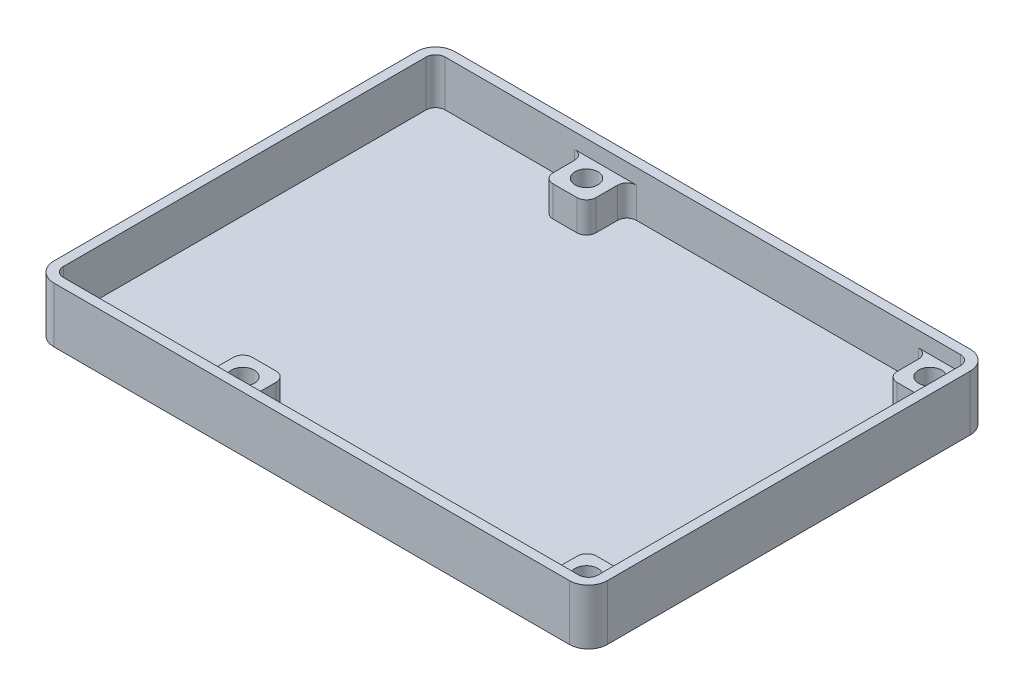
from build123d import *

# Parameters (mm, degrees)
SKETCH_1_W          = 56
SKETCH_1_H          = 40
EXTRUDE_1_DEPTH     = 1
FILLET_1_R          = 1
SKETCH_2_R          = 1.2
CUT_EXTRUDE_1_DEPTH = 1
EXTRUDE_START       = 5.8
EXTRUDE_2_DEPTH     = 5.8
SKETCH_5_W          = 4.4
SKETCH_5_H          = 4.5
SKETCH_5_R          = 1.2
SKETCH_5_W_2        = 4.5
EXTRUDE_3_DEPTH     = 3.2
FILLET_2_R          = 1
CHAMFER_1_SIZE      = 1


with BuildPart() as part:
    # Sketch 1 → Extrude 1 (new body)
    with BuildSketch(Plane(origin=(0, 0, 0), x_dir=(1, 0, 0), z_dir=(0, 1, 0))):
        Rectangle(SKETCH_1_W, SKETCH_1_H)
    extrude(amount=EXTRUDE_1_DEPTH)

    # Fillet 1
    fillet_1_edges = [part.edges().sort_by_distance(p)[0] for p in [
        (28, 0.5, 20),
        (-28, 0.5, 20),
        (-28, 0.5, -20),
        (28, 0.5, -20),
    ]]
    fillet(fillet_1_edges, radius=FILLET_1_R)

    # Sketch 2 → Cut-Extrude 1 (cut)
    with BuildSketch(Plane(origin=(0, 0, 0), x_dir=(1, 0, 0), z_dir=(0, 1, 0))):
        with Locations(Location((-10.2, 18, 0), (0, 0, 270))):
            Circle(SKETCH_2_R)
        with Locations(Location((25.8, 18, 0), (0, 0, 270))):
            Circle(SKETCH_2_R)
        with Locations(Location((25.8, -18, 0), (0, 0, 270))):
            Circle(SKETCH_2_R)
        with Locations(Location((-10.2, -18, 0), (0, 0, 270))):
            Circle(SKETCH_2_R)
    extrude(amount=CUT_EXTRUDE_1_DEPTH, mode=Mode.SUBTRACT)

    # Sketch 3 → Extrude 2 (add)
    with BuildSketch(Plane(origin=(0, 0, 0), x_dir=(1, 0, 0), z_dir=(0, 1, 0)).offset(EXTRUDE_START)):
        with BuildLine():
            Line((-29, 19), (-29, -19))
            ThreePointArc((-29, -19), (-28.414213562, -20.414213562), (-27, -21))
            Line((-27, -21), (27, -21))
            ThreePointArc((27, -21), (28.414213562, -20.414213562), (29, -19))
            Line((29, -19), (29, 19))
            ThreePointArc((29, 19), (28.414213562, 20.414213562), (27, 21))
            Line((27, 21), (-27, 21))
            ThreePointArc((-27, 21), (-28.414213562, 20.414213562), (-29, 19))
        make_face()
        with BuildLine():
            Line((-28, 19), (-28, -19))
            ThreePointArc((-28, -19), (-27.707106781, -19.707106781), (-27, -20))
            Line((-27, -20), (27, -20))
            ThreePointArc((27, -20), (27.707106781, -19.707106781), (28, -19))
            Line((28, -19), (28, 19))
            ThreePointArc((28, 19), (27.707106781, 19.707106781), (27, 20))
            Line((27, 20), (-27, 20))
            ThreePointArc((-27, 20), (-27.707106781, 19.707106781), (-28, 19))
        make_face(mode=Mode.SUBTRACT)
    extrude(amount=-EXTRUDE_2_DEPTH)

    # Sketch 5 → Extrude 3 (add)
    # profile 1 of 4: a face of its own
    with BuildSketch(Plane(origin=(0, 1, 0), x_dir=(1, 0, 0), z_dir=(0, 1, 0))):
        with Locations((25.8, 18)):
            Rectangle(SKETCH_5_W, SKETCH_5_H)
        with Locations(Location((25.8, 18, 0), (0, 0, 270))):
            Circle(SKETCH_5_R, mode=Mode.SUBTRACT)
    # profile 2 of 4: a face of its own
    with BuildSketch(Plane(origin=(0, 1, 0), x_dir=(1, 0, 0), z_dir=(0, 1, 0))):
        with Locations((25.8, -18)):
            Rectangle(SKETCH_5_W, SKETCH_5_H)
        with Locations(Location((25.8, -18, 0), (0, 0, 270))):
            Circle(SKETCH_5_R, mode=Mode.SUBTRACT)
    # profile 3 of 4: a face of its own
    with BuildSketch(Plane(origin=(0, 1, 0), x_dir=(1, 0, 0), z_dir=(0, 1, 0))):
        with Locations((-10.2, -18)):
            Rectangle(SKETCH_5_W_2, SKETCH_5_H)
        with Locations(Location((-10.2, -18, 0), (0, 0, 270))):
            Circle(SKETCH_5_R, mode=Mode.SUBTRACT)
    # profile 4 of 4: a face of its own
    with BuildSketch(Plane(origin=(0, 1, 0), x_dir=(1, 0, 0), z_dir=(0, 1, 0))):
        with Locations((-10.2, 18)):
            Rectangle(SKETCH_5_W_2, SKETCH_5_H)
        with Locations(Location((-10.2, 18, 0), (0, 0, 270))):
            Circle(SKETCH_5_R, mode=Mode.SUBTRACT)
    extrude(amount=EXTRUDE_3_DEPTH)

    # Fillet 2
    fillet_2_edges = [part.edges().sort_by_distance(p)[0] for p in [
        (23.6, 2.6, -20),
        (23.6, 2.6, -15.75),
        (28, 2.6, -15.75),
        (23.6, 2.6, 20),
        (23.6, 2.6, 15.75),
        (28, 2.6, 15.75),
        (-7.95, 2.6, 20),
        (-12.45, 2.6, 20),
        (-12.45, 2.6, 15.75),
        (-7.95, 2.6, 15.75),
        (-7.95, 2.6, -20),
        (-12.45, 2.6, -20),
        (-12.45, 2.6, -15.75),
        (-7.95, 2.6, -15.75),
    ]]
    fillet(fillet_2_edges, radius=FILLET_2_R)

    # Chamfer 1
    chamfer_1_edges = [part.edges().sort_by_distance(p)[0] for p in [
        (-10.2, 0, 16.8),
        (25.8, 0, 16.8),
        (25.8, 0, -19.2),
        (-10.2, 0, -19.2),
    ]]
    chamfer(chamfer_1_edges, length=CHAMFER_1_SIZE)


solid = part.part
